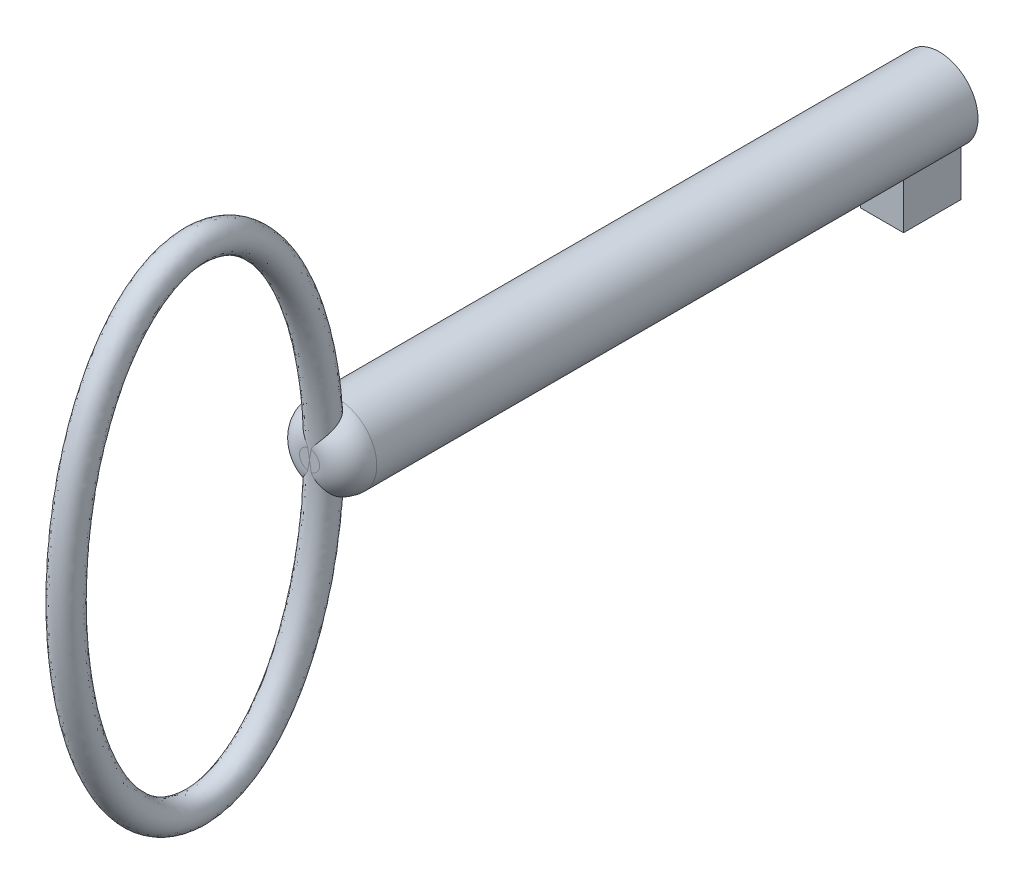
from build123d import *

# Parameters (mm, degrees)
EXTRUDE1_DEPTH = 3.175
SKETCH3_R      = 2.143125
EXTRUDE2_DEPTH = 31.75
FILLET4_R      = 1.5875
SKETCH5_R      = 0.79375
SKETCH6_R      = 0.79375
EXTRUDE4_DEPTH = 6.35


with BuildPart() as part:
    # Sketch2 → Extrude1 (new body)
    with BuildSketch(Plane.XY):
        with BuildLine():
            Line((1.190625, -4.365625), (1.190625, -1.78196433))
            ThreePointArc((1.190625, -1.78196433), (0, 2.143125), (-1.190625, -1.78196433))
            Line((-1.190625, -1.78196433), (-1.190625, -4.365625))
            Line((-1.190625, -4.365625), (1.190625, -4.365625))
        make_face()
    extrude(amount=EXTRUDE1_DEPTH)

    # Sketch3 → Extrude2 (add)
    with BuildSketch(Plane.XY.offset(3.175)):
        with Locations(Location((0, 0, 0), (0, 0, 236.251011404))):
            Circle(SKETCH3_R)
    extrude(amount=EXTRUDE2_DEPTH)

    # Fillet4
    fillet4_edges = [part.edges().sort_by_distance(p)[0] for p in [
        (1.190625, 1.78196433, 34.925),
    ]]
    fillet(fillet4_edges, radius=FILLET4_R)

    # Sweep1: sweep along a path in Sketch4
    with BuildLine(Plane(origin=(0, 0, 0), x_dir=(0, 0, -1), z_dir=(1, 0, 0))) as sweep1_path:
        EllipticalCenterArc((-41.275, 0), 12.7, 6.35, start_angle=0, arc_size=360, rotation=90)
    # Sketch5 → Sweep1 (sweep)
    with BuildSketch(Plane(origin=(0, 0, 0), x_dir=(1, 0, 0), z_dir=(0, 1, 0))):
        with Locations((0, -34.13125)):
            Circle(SKETCH5_R)
    sweep(path=sweep1_path.line)

    # Sketch6 → Extrude4 (cut)
    with BuildSketch(Plane(origin=(0, 0, 0), x_dir=(-1, 0, 0), z_dir=(0, 0, -1))):
        Circle(SKETCH6_R)
    extrude(amount=-EXTRUDE4_DEPTH, mode=Mode.SUBTRACT)


solid = part.part
